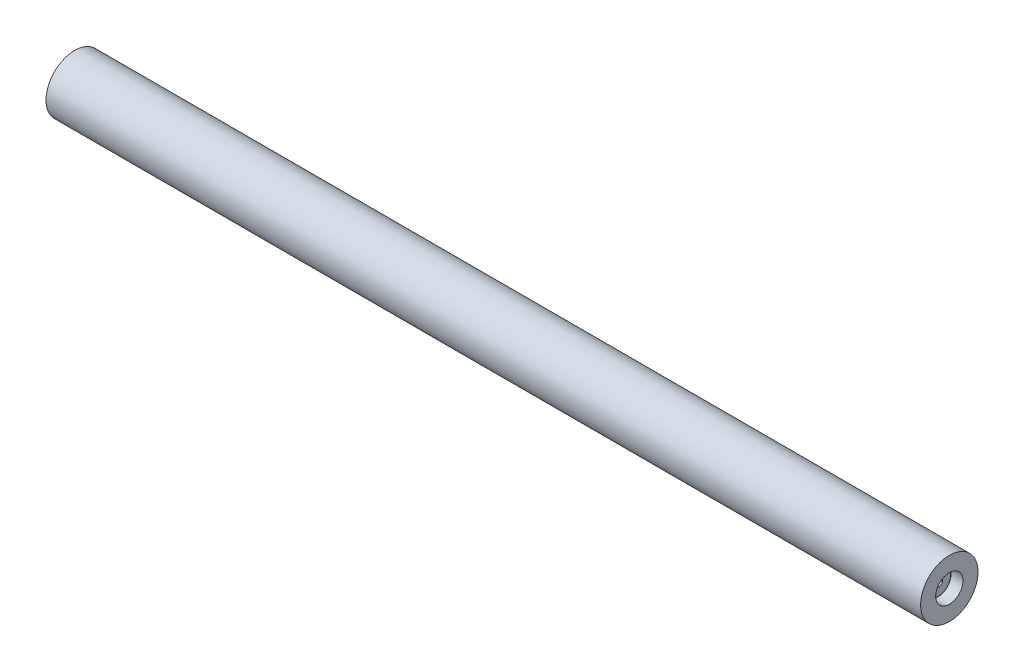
ISO-10303-21;
HEADER;
FILE_DESCRIPTION(('STEP AP214'),'2;1');
FILE_NAME('part.step','',(''),(''),'','','');
FILE_SCHEMA(('AUTOMOTIVE_DESIGN { 1 0 10303 214 1 1 1 1 }'));
ENDSEC;
DATA;
#1=APPLICATION_CONTEXT('core data for automotive mechanical design processes');
#2=APPLICATION_PROTOCOL_DEFINITION('international standard','automotive_design',2000,#1);
#3=PRODUCT_CONTEXT('',#1,'mechanical');
#4=PRODUCT('Part','Part','',(#3));
#5=PRODUCT_RELATED_PRODUCT_CATEGORY('part','',(#4));
#6=PRODUCT_DEFINITION_FORMATION('','',#4);
#7=PRODUCT_DEFINITION_CONTEXT('part definition',#1,'design');
#8=PRODUCT_DEFINITION('design','',#6,#7);
#9=PRODUCT_DEFINITION_SHAPE('','',#8);
#10=(LENGTH_UNIT() NAMED_UNIT(*) SI_UNIT(.MILLI.,.METRE.));
#11=(NAMED_UNIT(*) PLANE_ANGLE_UNIT() SI_UNIT($,.RADIAN.));
#12=(NAMED_UNIT(*) SI_UNIT($,.STERADIAN.) SOLID_ANGLE_UNIT());
#13=UNCERTAINTY_MEASURE_WITH_UNIT(LENGTH_MEASURE(1.E-05),#10,'distance_accuracy_value','');
#14=(GEOMETRIC_REPRESENTATION_CONTEXT(3) GLOBAL_UNCERTAINTY_ASSIGNED_CONTEXT((#13)) GLOBAL_UNIT_ASSIGNED_CONTEXT((#10,
#11,#12)) REPRESENTATION_CONTEXT('',''));
#15=CARTESIAN_POINT('',(0.,0.,0.));
#16=DIRECTION('',(0.,0.,1.));
#17=DIRECTION('',(1.,0.,0.));
#18=AXIS2_PLACEMENT_3D('',#15,#16,#17);
#19=CARTESIAN_POINT('',(4.7625,0.,0.));
#20=DIRECTION('',(1.,0.,0.));
#21=DIRECTION('',(0.,0.,-1.));
#22=AXIS2_PLACEMENT_3D('',#19,#20,#21);
#23=PLANE('',#22);
#24=CARTESIAN_POINT('',(4.7625,0.,0.));
#25=DIRECTION('',(-1.,0.,0.));
#26=DIRECTION('',(0.,0.,1.));
#27=AXIS2_PLACEMENT_3D('',#24,#25,#26);
#28=CIRCLE('',#27,5.2578);
#29=CARTESIAN_POINT('',(4.7625,0.,5.2578));
#30=VERTEX_POINT('',#29);
#31=EDGE_CURVE('E229',#30,#30,#28,.T.);
#32=ORIENTED_EDGE('',*,*,#31,.T.);
#33=EDGE_LOOP('',(#32));
#34=FACE_BOUND('',#33,.T.);
#35=DIRECTION('',(0.,-0.500000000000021,0.866025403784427));
#36=VECTOR('',#35,1.);
#37=CARTESIAN_POINT('',(4.7625,2.1190486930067,0.));
#38=LINE('',#37,#36);
#39=CARTESIAN_POINT('',(4.7625,2.1190486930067,0.));
#40=VERTEX_POINT('',#39);
#41=CARTESIAN_POINT('',(4.7625,1.0595243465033,1.83515));
#42=VERTEX_POINT('',#41);
#43=EDGE_CURVE('E47',#40,#42,#38,.T.);
#44=ORIENTED_EDGE('',*,*,#43,.T.);
#45=DIRECTION('',(0.,-1.,0.));
#46=VECTOR('',#45,1.);
#47=CARTESIAN_POINT('',(4.7625,1.0595243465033,1.83515));
#48=LINE('',#47,#46);
#49=CARTESIAN_POINT('',(4.7625,-1.0595243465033,1.83515));
#50=VERTEX_POINT('',#49);
#51=EDGE_CURVE('E123',#42,#50,#48,.T.);
#52=ORIENTED_EDGE('',*,*,#51,.T.);
#53=DIRECTION('',(0.,-0.500000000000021,-0.866025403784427));
#54=VECTOR('',#53,1.);
#55=CARTESIAN_POINT('',(4.7625,-1.0595243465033,1.83515));
#56=LINE('',#55,#54);
#57=CARTESIAN_POINT('',(4.7625,-2.1190486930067,0.));
#58=VERTEX_POINT('',#57);
#59=EDGE_CURVE('E131',#50,#58,#56,.T.);
#60=ORIENTED_EDGE('',*,*,#59,.T.);
#61=DIRECTION('',(0.,0.500000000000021,-0.866025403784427));
#62=VECTOR('',#61,1.);
#63=CARTESIAN_POINT('',(4.7625,-2.1190486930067,0.));
#64=LINE('',#63,#62);
#65=CARTESIAN_POINT('',(4.7625,-1.0595243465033,-1.83515));
#66=VERTEX_POINT('',#65);
#67=EDGE_CURVE('E145',#58,#66,#64,.T.);
#68=ORIENTED_EDGE('',*,*,#67,.T.);
#69=DIRECTION('',(0.,1.,0.));
#70=VECTOR('',#69,1.);
#71=CARTESIAN_POINT('',(4.7625,-1.0595243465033,-1.83515));
#72=LINE('',#71,#70);
#73=CARTESIAN_POINT('',(4.7625,1.0595243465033,-1.83515));
#74=VERTEX_POINT('',#73);
#75=EDGE_CURVE('E148',#66,#74,#72,.T.);
#76=ORIENTED_EDGE('',*,*,#75,.T.);
#77=DIRECTION('',(0.,0.500000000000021,0.866025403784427));
#78=VECTOR('',#77,1.);
#79=CARTESIAN_POINT('',(4.7625,1.0595243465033,-1.83515));
#80=LINE('',#79,#78);
#81=EDGE_CURVE('E141',#74,#40,#80,.T.);
#82=ORIENTED_EDGE('',*,*,#81,.T.);
#83=EDGE_LOOP('',(#44,#52,#60,#68,#76,#82));
#84=FACE_BOUND('',#83,.T.);
#85=ADVANCED_FACE('F32',(#34,#84),#23,.F.);
#86=CARTESIAN_POINT('',(371.475,0.,0.));
#87=DIRECTION('',(1.,0.,0.));
#88=DIRECTION('',(0.,0.,-1.));
#89=AXIS2_PLACEMENT_3D('',#86,#87,#88);
#90=PLANE('',#89);
#91=CARTESIAN_POINT('',(371.475,0.,0.));
#92=DIRECTION('',(1.,0.,0.));
#93=DIRECTION('',(0.,0.,-1.));
#94=AXIS2_PLACEMENT_3D('',#91,#92,#93);
#95=CIRCLE('',#94,5.9563);
#96=CARTESIAN_POINT('',(371.475,0.,-5.9563));
#97=VERTEX_POINT('',#96);
#98=EDGE_CURVE('E241',#97,#97,#95,.T.);
#99=ORIENTED_EDGE('',*,*,#98,.T.);
#100=EDGE_LOOP('',(#99));
#101=FACE_BOUND('',#100,.T.);
#102=CARTESIAN_POINT('',(371.475,0.,0.));
#103=DIRECTION('',(-1.,0.,0.));
#104=DIRECTION('',(0.,0.,1.));
#105=AXIS2_PLACEMENT_3D('',#102,#103,#104);
#106=CIRCLE('',#105,5.7658);
#107=CARTESIAN_POINT('',(371.475,0.,5.7658));
#108=VERTEX_POINT('',#107);
#109=EDGE_CURVE('E223',#108,#108,#106,.T.);
#110=ORIENTED_EDGE('',*,*,#109,.T.);
#111=EDGE_LOOP('',(#110));
#112=FACE_BOUND('',#111,.T.);
#113=ADVANCED_FACE('F269',(#101,#112),#90,.T.);
#114=CARTESIAN_POINT('',(9.525,0.,0.));
#115=DIRECTION('',(1.,0.,0.));
#116=DIRECTION('',(0.,0.,-1.));
#117=AXIS2_PLACEMENT_3D('',#114,#115,#116);
#118=PLANE('',#117);
#119=CARTESIAN_POINT('',(9.525,0.,0.));
#120=DIRECTION('',(1.,0.,0.));
#121=DIRECTION('',(0.,0.,-1.));
#122=AXIS2_PLACEMENT_3D('',#119,#120,#121);
#123=CIRCLE('',#122,5.9563);
#124=CARTESIAN_POINT('',(9.525,0.,5.9563));
#125=VERTEX_POINT('',#124);
#126=EDGE_CURVE('E235',#125,#125,#123,.T.);
#127=ORIENTED_EDGE('',*,*,#126,.F.);
#128=EDGE_LOOP('',(#127));
#129=FACE_BOUND('',#128,.T.);
#130=CARTESIAN_POINT('',(9.525,0.,0.));
#131=DIRECTION('',(1.,0.,0.));
#132=DIRECTION('',(0.,0.,-1.));
#133=AXIS2_PLACEMENT_3D('',#130,#131,#132);
#134=CIRCLE('',#133,5.7658);
#135=CARTESIAN_POINT('',(9.525,0.,-5.7658));
#136=VERTEX_POINT('',#135);
#137=EDGE_CURVE('E11',#136,#136,#134,.F.);
#138=ORIENTED_EDGE('',*,*,#137,.F.);
#139=EDGE_LOOP('',(#138));
#140=FACE_BOUND('',#139,.T.);
#141=ADVANCED_FACE('F275',(#129,#140),#118,.F.);
#142=CARTESIAN_POINT('',(0.,0.,0.));
#143=DIRECTION('',(1.,0.,0.));
#144=DIRECTION('',(0.,0.,-1.));
#145=AXIS2_PLACEMENT_3D('',#142,#143,#144);
#146=PLANE('',#145);
#147=CARTESIAN_POINT('',(0.,0.,0.));
#148=DIRECTION('',(-1.,0.,0.));
#149=DIRECTION('',(0.,0.,1.));
#150=AXIS2_PLACEMENT_3D('',#147,#148,#149);
#151=CIRCLE('',#150,12.5095);
#152=CARTESIAN_POINT('',(0.,0.,12.5095));
#153=VERTEX_POINT('',#152);
#154=EDGE_CURVE('E40',#153,#153,#151,.T.);
#155=ORIENTED_EDGE('',*,*,#154,.T.);
#156=EDGE_LOOP('',(#155));
#157=FACE_BOUND('',#156,.T.);
#158=CARTESIAN_POINT('',(0.,0.,0.));
#159=DIRECTION('',(1.,0.,0.));
#160=DIRECTION('',(0.,0.,-1.));
#161=AXIS2_PLACEMENT_3D('',#158,#159,#160);
#162=CIRCLE('',#161,5.9563);
#163=CARTESIAN_POINT('',(0.,0.,5.9563));
#164=VERTEX_POINT('',#163);
#165=EDGE_CURVE('E232',#164,#164,#162,.T.);
#166=ORIENTED_EDGE('',*,*,#165,.T.);
#167=EDGE_LOOP('',(#166));
#168=FACE_BOUND('',#167,.T.);
#169=ADVANCED_FACE('F34',(#157,#168),#146,.F.);
#170=CARTESIAN_POINT('',(381.,0.,0.));
#171=DIRECTION('',(-1.,0.,0.));
#172=DIRECTION('',(0.,0.,1.));
#173=AXIS2_PLACEMENT_3D('',#170,#171,#172);
#174=CYLINDRICAL_SURFACE('',#173,12.5095);
#175=ORIENTED_EDGE('',*,*,#154,.F.);
#176=EDGE_LOOP('',(#175));
#177=FACE_BOUND('',#176,.T.);
#178=CARTESIAN_POINT('',(381.,0.,0.));
#179=DIRECTION('',(-1.,0.,0.));
#180=DIRECTION('',(0.,0.,1.));
#181=AXIS2_PLACEMENT_3D('',#178,#179,#180);
#182=CIRCLE('',#181,12.5095);
#183=CARTESIAN_POINT('',(381.,0.,12.5095));
#184=VERTEX_POINT('',#183);
#185=EDGE_CURVE('E244',#184,#184,#182,.T.);
#186=ORIENTED_EDGE('',*,*,#185,.T.);
#187=EDGE_LOOP('',(#186));
#188=FACE_BOUND('',#187,.T.);
#189=ADVANCED_FACE('F251',(#177,#188),#174,.T.);
#190=CARTESIAN_POINT('',(381.,12.5095,0.));
#191=DIRECTION('',(-1.,0.,0.));
#192=DIRECTION('',(0.,0.,1.));
#193=AXIS2_PLACEMENT_3D('',#190,#191,#192);
#194=PLANE('',#193);
#195=CARTESIAN_POINT('',(381.,0.,0.));
#196=DIRECTION('',(1.,0.,0.));
#197=DIRECTION('',(0.,0.,-1.));
#198=AXIS2_PLACEMENT_3D('',#195,#196,#197);
#199=CIRCLE('',#198,5.9563);
#200=CARTESIAN_POINT('',(381.,0.,-5.9563));
#201=VERTEX_POINT('',#200);
#202=EDGE_CURVE('E238',#201,#201,#199,.T.);
#203=ORIENTED_EDGE('',*,*,#202,.F.);
#204=EDGE_LOOP('',(#203));
#205=FACE_BOUND('',#204,.T.);
#206=ORIENTED_EDGE('',*,*,#185,.F.);
#207=EDGE_LOOP('',(#206));
#208=FACE_BOUND('',#207,.T.);
#209=ADVANCED_FACE('F254',(#205,#208),#194,.F.);
#210=CARTESIAN_POINT('',(371.475,0.,0.));
#211=DIRECTION('',(1.,0.,0.));
#212=DIRECTION('',(0.,0.,-1.));
#213=AXIS2_PLACEMENT_3D('',#210,#211,#212);
#214=CYLINDRICAL_SURFACE('',#213,5.9563);
#215=CARTESIAN_POINT('',(371.475,0.,-5.9563));
#216=CARTESIAN_POINT('',(371.57421875,0.,-5.9563));
#217=CARTESIAN_POINT('',(371.6734375,0.,-5.9563));
#218=CARTESIAN_POINT('',(371.871875,0.,-5.9563));
#219=CARTESIAN_POINT('',(371.97109375,0.,-5.9563));
#220=CARTESIAN_POINT('',(372.16953125,0.,-5.9563));
#221=CARTESIAN_POINT('',(372.26875,0.,-5.9563));
#222=CARTESIAN_POINT('',(372.4671875,0.,-5.9563));
#223=CARTESIAN_POINT('',(372.56640625,0.,-5.9563));
#224=CARTESIAN_POINT('',(372.76484375,0.,-5.9563));
#225=CARTESIAN_POINT('',(372.8640625,0.,-5.9563));
#226=CARTESIAN_POINT('',(373.0625,0.,-5.9563));
#227=CARTESIAN_POINT('',(373.16171875,0.,-5.9563));
#228=CARTESIAN_POINT('',(373.36015625,0.,-5.9563));
#229=CARTESIAN_POINT('',(373.459375,0.,-5.9563));
#230=CARTESIAN_POINT('',(373.6578125,0.,-5.9563));
#231=CARTESIAN_POINT('',(373.75703125,0.,-5.9563));
#232=CARTESIAN_POINT('',(373.95546875,0.,-5.9563));
#233=CARTESIAN_POINT('',(374.0546875,0.,-5.9563));
#234=CARTESIAN_POINT('',(374.253125,0.,-5.9563));
#235=CARTESIAN_POINT('',(374.35234375,0.,-5.9563));
#236=CARTESIAN_POINT('',(374.55078125,0.,-5.9563));
#237=CARTESIAN_POINT('',(374.65,0.,-5.9563));
#238=CARTESIAN_POINT('',(374.8484375,0.,-5.9563));
#239=CARTESIAN_POINT('',(374.94765625,0.,-5.9563));
#240=CARTESIAN_POINT('',(375.14609375,0.,-5.9563));
#241=CARTESIAN_POINT('',(375.2453125,0.,-5.9563));
#242=CARTESIAN_POINT('',(375.44375,0.,-5.9563));
#243=CARTESIAN_POINT('',(375.54296875,0.,-5.9563));
#244=CARTESIAN_POINT('',(375.74140625,0.,-5.9563));
#245=CARTESIAN_POINT('',(375.840625,0.,-5.9563));
#246=CARTESIAN_POINT('',(376.0390625,0.,-5.9563));
#247=CARTESIAN_POINT('',(376.13828125,0.,-5.9563));
#248=CARTESIAN_POINT('',(376.33671875,0.,-5.9563));
#249=CARTESIAN_POINT('',(376.4359375,0.,-5.9563));
#250=CARTESIAN_POINT('',(376.634375,0.,-5.9563));
#251=CARTESIAN_POINT('',(376.73359375,0.,-5.9563));
#252=CARTESIAN_POINT('',(376.93203125,0.,-5.9563));
#253=CARTESIAN_POINT('',(377.03125,0.,-5.9563));
#254=CARTESIAN_POINT('',(377.2296875,0.,-5.9563));
#255=CARTESIAN_POINT('',(377.32890625,0.,-5.9563));
#256=CARTESIAN_POINT('',(377.52734375,0.,-5.9563));
#257=CARTESIAN_POINT('',(377.6265625,0.,-5.9563));
#258=CARTESIAN_POINT('',(377.825,0.,-5.9563));
#259=CARTESIAN_POINT('',(377.92421875,0.,-5.9563));
#260=CARTESIAN_POINT('',(378.12265625,0.,-5.9563));
#261=CARTESIAN_POINT('',(378.221875,0.,-5.9563));
#262=CARTESIAN_POINT('',(378.4203125,0.,-5.9563));
#263=CARTESIAN_POINT('',(378.51953125,0.,-5.9563));
#264=CARTESIAN_POINT('',(378.71796875,0.,-5.9563));
#265=CARTESIAN_POINT('',(378.8171875,0.,-5.9563));
#266=CARTESIAN_POINT('',(379.015625,0.,-5.9563));
#267=CARTESIAN_POINT('',(379.11484375,0.,-5.9563));
#268=CARTESIAN_POINT('',(379.31328125,0.,-5.9563));
#269=CARTESIAN_POINT('',(379.4125,0.,-5.9563));
#270=CARTESIAN_POINT('',(379.6109375,0.,-5.9563));
#271=CARTESIAN_POINT('',(379.71015625,0.,-5.9563));
#272=CARTESIAN_POINT('',(379.90859375,0.,-5.9563));
#273=CARTESIAN_POINT('',(380.0078125,0.,-5.9563));
#274=CARTESIAN_POINT('',(380.20625,0.,-5.9563));
#275=CARTESIAN_POINT('',(380.30546875,0.,-5.9563));
#276=CARTESIAN_POINT('',(380.50390625,0.,-5.9563));
#277=CARTESIAN_POINT('',(380.603125,0.,-5.9563));
#278=CARTESIAN_POINT('',(380.8015625,0.,-5.9563));
#279=CARTESIAN_POINT('',(380.90078125,0.,-5.9563));
#280=CARTESIAN_POINT('',(381.,0.,-5.9563));
#281=B_SPLINE_CURVE_WITH_KNOTS('',3,(#215,#216,#217,#218,#219,#220,#221,#222,#223,#224,#225,
#226,#227,#228,#229,#230,#231,#232,#233,#234,#235,#236,#237,#238,#239,#240,#241,#242,#243,#244,
#245,#246,#247,#248,#249,#250,#251,#252,#253,#254,#255,#256,#257,#258,#259,#260,#261,#262,#263,
#264,#265,#266,#267,#268,#269,#270,#271,#272,#273,#274,#275,#276,#277,#278,#279,#280),
.UNSPECIFIED.,.F.,.F.,(4,2,2,2,2,2,2,2,2,2,2,2,2,2,2,2,2,2,2,2,2,2,2,2,2,2,2,2,2,2,2,2,4),(0.,
0.29765625,0.5953125,0.892968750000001,1.190625,1.48828125,1.7859375,2.08359375,2.38125,
2.67890625,2.9765625,3.27421875,3.571875,3.86953125,4.1671875,4.46484375,4.7625,5.06015625,
5.3578125,5.65546875,5.953125,6.25078125,6.5484375,6.84609375,7.14375,7.44140625,7.7390625,
8.03671875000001,8.334375,8.63203125,8.92968750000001,9.22734375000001,9.52500000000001),.UNSPECIFIED.);
#282=EDGE_CURVE('BSEAM258',#97,#201,#281,.T.);
#283=ORIENTED_EDGE('',*,*,#98,.F.);
#284=ORIENTED_EDGE('',*,*,#202,.T.);
#285=ORIENTED_EDGE('',*,*,#282,.T.);
#286=ORIENTED_EDGE('',*,*,#282,.F.);
#287=EDGE_LOOP('',(#283,#285,#284,#286));
#288=FACE_BOUND('',#287,.T.);
#289=ADVANCED_FACE('F258',(#288),#214,.F.);
#290=CARTESIAN_POINT('',(9.525,0.,0.));
#291=DIRECTION('',(-1.,0.,0.));
#292=DIRECTION('',(0.,0.,1.));
#293=AXIS2_PLACEMENT_3D('',#290,#291,#292);
#294=CYLINDRICAL_SURFACE('',#293,5.9563);
#295=CARTESIAN_POINT('',(9.525,0.,5.9563));
#296=CARTESIAN_POINT('',(9.42578125,0.,5.9563));
#297=CARTESIAN_POINT('',(9.3265625,0.,5.9563));
#298=CARTESIAN_POINT('',(9.128125,0.,5.9563));
#299=CARTESIAN_POINT('',(9.02890625,0.,5.9563));
#300=CARTESIAN_POINT('',(8.83046875,0.,5.9563));
#301=CARTESIAN_POINT('',(8.73125,0.,5.9563));
#302=CARTESIAN_POINT('',(8.5328125,0.,5.9563));
#303=CARTESIAN_POINT('',(8.43359375,0.,5.9563));
#304=CARTESIAN_POINT('',(8.23515625,0.,5.9563));
#305=CARTESIAN_POINT('',(8.1359375,0.,5.9563));
#306=CARTESIAN_POINT('',(7.9375,0.,5.9563));
#307=CARTESIAN_POINT('',(7.83828125,0.,5.9563));
#308=CARTESIAN_POINT('',(7.63984375,0.,5.9563));
#309=CARTESIAN_POINT('',(7.540625,0.,5.9563));
#310=CARTESIAN_POINT('',(7.3421875,0.,5.9563));
#311=CARTESIAN_POINT('',(7.24296875,0.,5.9563));
#312=CARTESIAN_POINT('',(7.04453125,0.,5.9563));
#313=CARTESIAN_POINT('',(6.9453125,0.,5.9563));
#314=CARTESIAN_POINT('',(6.746875,0.,5.9563));
#315=CARTESIAN_POINT('',(6.64765625,0.,5.9563));
#316=CARTESIAN_POINT('',(6.44921875,0.,5.9563));
#317=CARTESIAN_POINT('',(6.35,0.,5.9563));
#318=CARTESIAN_POINT('',(6.1515625,0.,5.9563));
#319=CARTESIAN_POINT('',(6.05234375,0.,5.9563));
#320=CARTESIAN_POINT('',(5.85390625,0.,5.9563));
#321=CARTESIAN_POINT('',(5.7546875,0.,5.9563));
#322=CARTESIAN_POINT('',(5.55625,0.,5.9563));
#323=CARTESIAN_POINT('',(5.45703125,0.,5.9563));
#324=CARTESIAN_POINT('',(5.25859375,0.,5.9563));
#325=CARTESIAN_POINT('',(5.159375,0.,5.9563));
#326=CARTESIAN_POINT('',(4.9609375,0.,5.9563));
#327=CARTESIAN_POINT('',(4.86171875,0.,5.9563));
#328=CARTESIAN_POINT('',(4.66328125,0.,5.9563));
#329=CARTESIAN_POINT('',(4.5640625,0.,5.9563));
#330=CARTESIAN_POINT('',(4.365625,0.,5.9563));
#331=CARTESIAN_POINT('',(4.26640625,0.,5.9563));
#332=CARTESIAN_POINT('',(4.06796875,0.,5.9563));
#333=CARTESIAN_POINT('',(3.96875,0.,5.9563));
#334=CARTESIAN_POINT('',(3.7703125,0.,5.9563));
#335=CARTESIAN_POINT('',(3.67109375,0.,5.9563));
#336=CARTESIAN_POINT('',(3.47265625,0.,5.9563));
#337=CARTESIAN_POINT('',(3.3734375,0.,5.9563));
#338=CARTESIAN_POINT('',(3.175,0.,5.9563));
#339=CARTESIAN_POINT('',(3.07578125,0.,5.9563));
#340=CARTESIAN_POINT('',(2.87734375,0.,5.9563));
#341=CARTESIAN_POINT('',(2.778125,0.,5.9563));
#342=CARTESIAN_POINT('',(2.5796875,0.,5.9563));
#343=CARTESIAN_POINT('',(2.48046875,0.,5.9563));
#344=CARTESIAN_POINT('',(2.28203125,0.,5.9563));
#345=CARTESIAN_POINT('',(2.1828125,0.,5.9563));
#346=CARTESIAN_POINT('',(1.984375,0.,5.9563));
#347=CARTESIAN_POINT('',(1.88515625,0.,5.9563));
#348=CARTESIAN_POINT('',(1.68671875,0.,5.9563));
#349=CARTESIAN_POINT('',(1.5875,0.,5.9563));
#350=CARTESIAN_POINT('',(1.3890625,0.,5.9563));
#351=CARTESIAN_POINT('',(1.28984375,0.,5.9563));
#352=CARTESIAN_POINT('',(1.09140625,0.,5.9563));
#353=CARTESIAN_POINT('',(0.992187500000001,0.,5.9563));
#354=CARTESIAN_POINT('',(0.793750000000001,0.,5.9563));
#355=CARTESIAN_POINT('',(0.69453125,0.,5.9563));
#356=CARTESIAN_POINT('',(0.49609375,0.,5.9563));
#357=CARTESIAN_POINT('',(0.396875,0.,5.9563));
#358=CARTESIAN_POINT('',(0.1984375,0.,5.9563));
#359=CARTESIAN_POINT('',(0.0992187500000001,0.,5.9563));
#360=CARTESIAN_POINT('',(0.,0.,5.9563));
#361=B_SPLINE_CURVE_WITH_KNOTS('',3,(#295,#296,#297,#298,#299,#300,#301,#302,#303,#304,#305,
#306,#307,#308,#309,#310,#311,#312,#313,#314,#315,#316,#317,#318,#319,#320,#321,#322,#323,#324,
#325,#326,#327,#328,#329,#330,#331,#332,#333,#334,#335,#336,#337,#338,#339,#340,#341,#342,#343,
#344,#345,#346,#347,#348,#349,#350,#351,#352,#353,#354,#355,#356,#357,#358,#359,#360),
.UNSPECIFIED.,.F.,.F.,(4,2,2,2,2,2,2,2,2,2,2,2,2,2,2,2,2,2,2,2,2,2,2,2,2,2,2,2,2,2,2,2,4),(0.,
0.29765625,0.5953125,0.892968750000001,1.190625,1.48828125,1.7859375,2.08359375,2.38125,
2.67890625,2.9765625,3.27421875,3.571875,3.86953125,4.1671875,4.46484375,4.7625,5.06015625,
5.3578125,5.65546875,5.953125,6.25078125,6.5484375,6.84609375,7.14375,7.44140625,7.7390625,
8.03671875,8.334375,8.63203125,8.9296875,9.22734375,9.525),.UNSPECIFIED.);
#362=EDGE_CURVE('BSEAM264',#125,#164,#361,.T.);
#363=ORIENTED_EDGE('',*,*,#126,.T.);
#364=ORIENTED_EDGE('',*,*,#165,.F.);
#365=ORIENTED_EDGE('',*,*,#362,.T.);
#366=ORIENTED_EDGE('',*,*,#362,.F.);
#367=EDGE_LOOP('',(#363,#365,#364,#366));
#368=FACE_BOUND('',#367,.T.);
#369=ADVANCED_FACE('F264',(#368),#294,.F.);
#370=CARTESIAN_POINT('',(5.27049999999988,0.,0.));
#371=DIRECTION('',(-1.,0.,0.));
#372=DIRECTION('',(0.,0.,1.));
#373=AXIS2_PLACEMENT_3D('',#370,#371,#372);
#374=TOROIDAL_SURFACE('',#373,5.25780000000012,0.507999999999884);
#375=ORIENTED_EDGE('',*,*,#31,.F.);
#376=EDGE_LOOP('',(#375));
#377=FACE_BOUND('',#376,.T.);
#378=CARTESIAN_POINT('',(5.2705,0.,0.));
#379=DIRECTION('',(-1.,0.,0.));
#380=DIRECTION('',(0.,0.,1.));
#381=AXIS2_PLACEMENT_3D('',#378,#379,#380);
#382=CIRCLE('',#381,5.7658);
#383=CARTESIAN_POINT('',(5.2705,0.,5.7658));
#384=VERTEX_POINT('',#383);
#385=EDGE_CURVE('E226',#384,#384,#382,.T.);
#386=ORIENTED_EDGE('',*,*,#385,.T.);
#387=EDGE_LOOP('',(#386));
#388=FACE_BOUND('',#387,.T.);
#389=ADVANCED_FACE('F280',(#377,#388),#374,.T.);
#390=CARTESIAN_POINT('',(9.525,0.,0.));
#391=DIRECTION('',(-1.,0.,0.));
#392=DIRECTION('',(0.,0.,1.));
#393=AXIS2_PLACEMENT_3D('',#390,#391,#392);
#394=CYLINDRICAL_SURFACE('',#393,5.7658);
#395=ORIENTED_EDGE('',*,*,#385,.F.);
#396=EDGE_LOOP('',(#395));
#397=FACE_BOUND('',#396,.T.);
#398=ORIENTED_EDGE('',*,*,#137,.T.);
#399=EDGE_LOOP('',(#398));
#400=FACE_BOUND('',#399,.T.);
#401=ADVANCED_FACE('F290',(#397,#400),#394,.T.);
#402=CARTESIAN_POINT('',(376.2375,0.,0.));
#403=DIRECTION('',(-1.,0.,0.));
#404=DIRECTION('',(0.,0.,1.));
#405=AXIS2_PLACEMENT_3D('',#402,#403,#404);
#406=CYLINDRICAL_SURFACE('',#405,5.7658);
#407=ORIENTED_EDGE('',*,*,#109,.F.);
#408=EDGE_LOOP('',(#407));
#409=FACE_BOUND('',#408,.T.);
#410=CARTESIAN_POINT('',(375.7295,0.,0.));
#411=DIRECTION('',(-1.,0.,0.));
#412=DIRECTION('',(0.,0.,1.));
#413=AXIS2_PLACEMENT_3D('',#410,#411,#412);
#414=CIRCLE('',#413,5.7658);
#415=CARTESIAN_POINT('',(375.7295,0.,5.7658));
#416=VERTEX_POINT('',#415);
#417=EDGE_CURVE('E220',#416,#416,#414,.T.);
#418=ORIENTED_EDGE('',*,*,#417,.T.);
#419=EDGE_LOOP('',(#418));
#420=FACE_BOUND('',#419,.T.);
#421=ADVANCED_FACE('F339',(#409,#420),#406,.T.);
#422=CARTESIAN_POINT('',(375.729499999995,0.,0.));
#423=DIRECTION('',(-1.,0.,0.));
#424=DIRECTION('',(0.,0.,1.));
#425=AXIS2_PLACEMENT_3D('',#422,#423,#424);
#426=TOROIDAL_SURFACE('',#425,5.25779999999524,0.508000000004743);
#427=ORIENTED_EDGE('',*,*,#417,.F.);
#428=EDGE_LOOP('',(#427));
#429=FACE_BOUND('',#428,.T.);
#430=CARTESIAN_POINT('',(376.2375,0.,0.));
#431=DIRECTION('',(-1.,0.,0.));
#432=DIRECTION('',(0.,0.,1.));
#433=AXIS2_PLACEMENT_3D('',#430,#431,#432);
#434=CIRCLE('',#433,5.2578);
#435=CARTESIAN_POINT('',(376.2375,0.,5.2578));
#436=VERTEX_POINT('',#435);
#437=EDGE_CURVE('E208',#436,#436,#434,.T.);
#438=ORIENTED_EDGE('',*,*,#437,.T.);
#439=EDGE_LOOP('',(#438));
#440=FACE_BOUND('',#439,.T.);
#441=ADVANCED_FACE('F352',(#429,#440),#426,.T.);
#442=CARTESIAN_POINT('',(376.2375,5.2578,0.));
#443=DIRECTION('',(-1.,0.,0.));
#444=DIRECTION('',(0.,0.,1.));
#445=AXIS2_PLACEMENT_3D('',#442,#443,#444);
#446=PLANE('',#445);
#447=DIRECTION('',(0.,-1.,0.));
#448=VECTOR('',#447,1.);
#449=CARTESIAN_POINT('',(376.2375,1.0595243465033,1.83515));
#450=LINE('',#449,#448);
#451=CARTESIAN_POINT('',(376.2375,1.0595243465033,1.83515));
#452=VERTEX_POINT('',#451);
#453=CARTESIAN_POINT('',(376.2375,-1.0595243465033,1.83515));
#454=VERTEX_POINT('',#453);
#455=EDGE_CURVE('E172',#452,#454,#450,.T.);
#456=ORIENTED_EDGE('',*,*,#455,.F.);
#457=DIRECTION('',(0.,-0.500000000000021,0.866025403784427));
#458=VECTOR('',#457,1.);
#459=CARTESIAN_POINT('',(376.2375,2.1190486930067,0.));
#460=LINE('',#459,#458);
#461=CARTESIAN_POINT('',(376.2375,2.1190486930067,0.));
#462=VERTEX_POINT('',#461);
#463=EDGE_CURVE('E55',#462,#452,#460,.T.);
#464=ORIENTED_EDGE('',*,*,#463,.F.);
#465=DIRECTION('',(0.,0.500000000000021,0.866025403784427));
#466=VECTOR('',#465,1.);
#467=CARTESIAN_POINT('',(376.2375,1.0595243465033,-1.83515));
#468=LINE('',#467,#466);
#469=CARTESIAN_POINT('',(376.2375,1.0595243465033,-1.83515));
#470=VERTEX_POINT('',#469);
#471=EDGE_CURVE('E184',#470,#462,#468,.T.);
#472=ORIENTED_EDGE('',*,*,#471,.F.);
#473=DIRECTION('',(0.,1.,0.));
#474=VECTOR('',#473,1.);
#475=CARTESIAN_POINT('',(376.2375,-1.0595243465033,-1.83515));
#476=LINE('',#475,#474);
#477=CARTESIAN_POINT('',(376.2375,-1.0595243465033,-1.83515));
#478=VERTEX_POINT('',#477);
#479=EDGE_CURVE('E181',#478,#470,#476,.T.);
#480=ORIENTED_EDGE('',*,*,#479,.F.);
#481=DIRECTION('',(0.,0.500000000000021,-0.866025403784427));
#482=VECTOR('',#481,1.);
#483=CARTESIAN_POINT('',(376.2375,-2.1190486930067,0.));
#484=LINE('',#483,#482);
#485=CARTESIAN_POINT('',(376.2375,-2.1190486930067,0.));
#486=VERTEX_POINT('',#485);
#487=EDGE_CURVE('E178',#486,#478,#484,.T.);
#488=ORIENTED_EDGE('',*,*,#487,.F.);
#489=DIRECTION('',(0.,-0.500000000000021,-0.866025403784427));
#490=VECTOR('',#489,1.);
#491=CARTESIAN_POINT('',(376.2375,-1.0595243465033,1.83515));
#492=LINE('',#491,#490);
#493=EDGE_CURVE('E175',#454,#486,#492,.T.);
#494=ORIENTED_EDGE('',*,*,#493,.F.);
#495=EDGE_LOOP('',(#456,#464,#472,#480,#488,#494));
#496=FACE_BOUND('',#495,.T.);
#497=ORIENTED_EDGE('',*,*,#437,.F.);
#498=EDGE_LOOP('',(#497));
#499=FACE_BOUND('',#498,.T.);
#500=ADVANCED_FACE('F361',(#496,#499),#446,.F.);
#501=CARTESIAN_POINT('',(373.85625,2.1190486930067,0.));
#502=DIRECTION('',(0.,0.866025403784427,0.500000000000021));
#503=DIRECTION('',(0.,-0.500000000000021,0.866025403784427));
#504=AXIS2_PLACEMENT_3D('',#501,#502,#503);
#505=PLANE('',#504);
#506=ORIENTED_EDGE('',*,*,#463,.T.);
#507=DIRECTION('',(1.,0.,0.));
#508=VECTOR('',#507,1.);
#509=CARTESIAN_POINT('',(373.85625,1.0595243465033,1.83515));
#510=LINE('',#509,#508);
#511=CARTESIAN_POINT('',(373.85625,1.0595243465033,1.83515));
#512=VERTEX_POINT('',#511);
#513=EDGE_CURVE('E205',#512,#452,#510,.T.);
#514=ORIENTED_EDGE('',*,*,#513,.F.);
#515=DIRECTION('',(0.,-0.500000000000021,0.866025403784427));
#516=VECTOR('',#515,1.);
#517=CARTESIAN_POINT('',(373.85625,2.1190486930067,0.));
#518=LINE('',#517,#516);
#519=CARTESIAN_POINT('',(373.85625,2.1190486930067,0.));
#520=VERTEX_POINT('',#519);
#521=EDGE_CURVE('E187',#520,#512,#518,.T.);
#522=ORIENTED_EDGE('',*,*,#521,.F.);
#523=DIRECTION('',(1.,0.,0.));
#524=VECTOR('',#523,1.);
#525=CARTESIAN_POINT('',(373.85625,2.1190486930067,0.));
#526=LINE('',#525,#524);
#527=EDGE_CURVE('E206',#520,#462,#526,.T.);
#528=ORIENTED_EDGE('',*,*,#527,.T.);
#529=EDGE_LOOP('',(#506,#514,#522,#528));
#530=FACE_BOUND('',#529,.T.);
#531=ADVANCED_FACE('F370',(#530),#505,.F.);
#532=CARTESIAN_POINT('',(373.85625,1.0595243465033,-1.83515));
#533=DIRECTION('',(0.,0.866025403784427,-0.500000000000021));
#534=DIRECTION('',(0.,0.500000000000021,0.866025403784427));
#535=AXIS2_PLACEMENT_3D('',#532,#533,#534);
#536=PLANE('',#535);
#537=ORIENTED_EDGE('',*,*,#471,.T.);
#538=ORIENTED_EDGE('',*,*,#527,.F.);
#539=DIRECTION('',(0.,0.500000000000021,0.866025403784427));
#540=VECTOR('',#539,1.);
#541=CARTESIAN_POINT('',(373.85625,1.0595243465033,-1.83515));
#542=LINE('',#541,#540);
#543=CARTESIAN_POINT('',(373.85625,1.0595243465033,-1.83515));
#544=VERTEX_POINT('',#543);
#545=EDGE_CURVE('E202',#544,#520,#542,.T.);
#546=ORIENTED_EDGE('',*,*,#545,.F.);
#547=DIRECTION('',(1.,0.,0.));
#548=VECTOR('',#547,1.);
#549=CARTESIAN_POINT('',(373.85625,1.0595243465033,-1.83515));
#550=LINE('',#549,#548);
#551=EDGE_CURVE('E209',#544,#470,#550,.T.);
#552=ORIENTED_EDGE('',*,*,#551,.T.);
#553=EDGE_LOOP('',(#537,#538,#546,#552));
#554=FACE_BOUND('',#553,.T.);
#555=ADVANCED_FACE('F379',(#554),#536,.F.);
#556=CARTESIAN_POINT('',(373.85625,-1.0595243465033,-1.83515));
#557=DIRECTION('',(0.,0.,-1.));
#558=DIRECTION('',(-1.,0.,0.));
#559=AXIS2_PLACEMENT_3D('',#556,#557,#558);
#560=PLANE('',#559);
#561=ORIENTED_EDGE('',*,*,#479,.T.);
#562=ORIENTED_EDGE('',*,*,#551,.F.);
#563=DIRECTION('',(0.,1.,0.));
#564=VECTOR('',#563,1.);
#565=CARTESIAN_POINT('',(373.85625,-1.0595243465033,-1.83515));
#566=LINE('',#565,#564);
#567=CARTESIAN_POINT('',(373.85625,-1.0595243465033,-1.83515));
#568=VERTEX_POINT('',#567);
#569=EDGE_CURVE('E199',#568,#544,#566,.T.);
#570=ORIENTED_EDGE('',*,*,#569,.F.);
#571=DIRECTION('',(1.,0.,0.));
#572=VECTOR('',#571,1.);
#573=CARTESIAN_POINT('',(373.85625,-1.0595243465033,-1.83515));
#574=LINE('',#573,#572);
#575=EDGE_CURVE('E211',#568,#478,#574,.T.);
#576=ORIENTED_EDGE('',*,*,#575,.T.);
#577=EDGE_LOOP('',(#561,#562,#570,#576));
#578=FACE_BOUND('',#577,.T.);
#579=ADVANCED_FACE('F387',(#578),#560,.F.);
#580=CARTESIAN_POINT('',(373.85625,-2.1190486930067,0.));
#581=DIRECTION('',(0.,-0.866025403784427,-0.500000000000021));
#582=DIRECTION('',(0.,0.500000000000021,-0.866025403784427));
#583=AXIS2_PLACEMENT_3D('',#580,#581,#582);
#584=PLANE('',#583);
#585=ORIENTED_EDGE('',*,*,#487,.T.);
#586=ORIENTED_EDGE('',*,*,#575,.F.);
#587=DIRECTION('',(0.,0.500000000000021,-0.866025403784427));
#588=VECTOR('',#587,1.);
#589=CARTESIAN_POINT('',(373.85625,-2.1190486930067,0.));
#590=LINE('',#589,#588);
#591=CARTESIAN_POINT('',(373.85625,-2.1190486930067,0.));
#592=VERTEX_POINT('',#591);
#593=EDGE_CURVE('E196',#592,#568,#590,.T.);
#594=ORIENTED_EDGE('',*,*,#593,.F.);
#595=DIRECTION('',(1.,0.,0.));
#596=VECTOR('',#595,1.);
#597=CARTESIAN_POINT('',(373.85625,-2.1190486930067,0.));
#598=LINE('',#597,#596);
#599=EDGE_CURVE('E213',#592,#486,#598,.T.);
#600=ORIENTED_EDGE('',*,*,#599,.T.);
#601=EDGE_LOOP('',(#585,#586,#594,#600));
#602=FACE_BOUND('',#601,.T.);
#603=ADVANCED_FACE('F396',(#602),#584,.F.);
#604=CARTESIAN_POINT('',(373.85625,-1.0595243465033,1.83515));
#605=DIRECTION('',(0.,-0.866025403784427,0.500000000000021));
#606=DIRECTION('',(0.,-0.500000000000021,-0.866025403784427));
#607=AXIS2_PLACEMENT_3D('',#604,#605,#606);
#608=PLANE('',#607);
#609=ORIENTED_EDGE('',*,*,#493,.T.);
#610=ORIENTED_EDGE('',*,*,#599,.F.);
#611=DIRECTION('',(0.,-0.500000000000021,-0.866025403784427));
#612=VECTOR('',#611,1.);
#613=CARTESIAN_POINT('',(373.85625,-1.0595243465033,1.83515));
#614=LINE('',#613,#612);
#615=CARTESIAN_POINT('',(373.85625,-1.0595243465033,1.83515));
#616=VERTEX_POINT('',#615);
#617=EDGE_CURVE('E193',#616,#592,#614,.T.);
#618=ORIENTED_EDGE('',*,*,#617,.F.);
#619=DIRECTION('',(1.,0.,0.));
#620=VECTOR('',#619,1.);
#621=CARTESIAN_POINT('',(373.85625,-1.0595243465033,1.83515));
#622=LINE('',#621,#620);
#623=EDGE_CURVE('E215',#616,#454,#622,.T.);
#624=ORIENTED_EDGE('',*,*,#623,.T.);
#625=EDGE_LOOP('',(#609,#610,#618,#624));
#626=FACE_BOUND('',#625,.T.);
#627=ADVANCED_FACE('F405',(#626),#608,.F.);
#628=CARTESIAN_POINT('',(373.85625,1.0595243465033,1.83515));
#629=DIRECTION('',(0.,0.,1.));
#630=DIRECTION('',(1.,0.,0.));
#631=AXIS2_PLACEMENT_3D('',#628,#629,#630);
#632=PLANE('',#631);
#633=ORIENTED_EDGE('',*,*,#455,.T.);
#634=ORIENTED_EDGE('',*,*,#623,.F.);
#635=DIRECTION('',(0.,-1.,0.));
#636=VECTOR('',#635,1.);
#637=CARTESIAN_POINT('',(373.85625,1.0595243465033,1.83515));
#638=LINE('',#637,#636);
#639=EDGE_CURVE('E190',#512,#616,#638,.T.);
#640=ORIENTED_EDGE('',*,*,#639,.F.);
#641=ORIENTED_EDGE('',*,*,#513,.T.);
#642=EDGE_LOOP('',(#633,#634,#640,#641));
#643=FACE_BOUND('',#642,.T.);
#644=ADVANCED_FACE('F414',(#643),#632,.F.);
#645=CARTESIAN_POINT('',(373.85625,0.,3.67029999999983));
#646=DIRECTION('',(1.,0.,0.));
#647=DIRECTION('',(0.,0.,-1.));
#648=AXIS2_PLACEMENT_3D('',#645,#646,#647);
#649=PLANE('',#648);
#650=ORIENTED_EDGE('',*,*,#521,.T.);
#651=ORIENTED_EDGE('',*,*,#639,.T.);
#652=ORIENTED_EDGE('',*,*,#617,.T.);
#653=ORIENTED_EDGE('',*,*,#593,.T.);
#654=ORIENTED_EDGE('',*,*,#569,.T.);
#655=ORIENTED_EDGE('',*,*,#545,.T.);
#656=EDGE_LOOP('',(#650,#651,#652,#653,#654,#655));
#657=FACE_BOUND('',#656,.T.);
#658=ADVANCED_FACE('F423',(#657),#649,.T.);
#659=CARTESIAN_POINT('',(7.14375,2.1190486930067,0.));
#660=DIRECTION('',(0.,-0.866025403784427,-0.500000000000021));
#661=DIRECTION('',(0.,0.500000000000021,-0.866025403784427));
#662=AXIS2_PLACEMENT_3D('',#659,#660,#661);
#663=PLANE('',#662);
#664=ORIENTED_EDGE('',*,*,#43,.F.);
#665=DIRECTION('',(-1.,0.,0.));
#666=VECTOR('',#665,1.);
#667=CARTESIAN_POINT('',(7.14375,2.1190486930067,0.));
#668=LINE('',#667,#666);
#669=CARTESIAN_POINT('',(7.14375,2.1190486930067,0.));
#670=VERTEX_POINT('',#669);
#671=EDGE_CURVE('E162',#670,#40,#668,.T.);
#672=ORIENTED_EDGE('',*,*,#671,.F.);
#673=DIRECTION('',(0.,-0.500000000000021,0.866025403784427));
#674=VECTOR('',#673,1.);
#675=CARTESIAN_POINT('',(7.14375,2.1190486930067,0.));
#676=LINE('',#675,#674);
#677=CARTESIAN_POINT('',(7.14375,1.0595243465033,1.83515));
#678=VERTEX_POINT('',#677);
#679=EDGE_CURVE('E136',#670,#678,#676,.T.);
#680=ORIENTED_EDGE('',*,*,#679,.T.);
#681=DIRECTION('',(-1.,0.,0.));
#682=VECTOR('',#681,1.);
#683=CARTESIAN_POINT('',(7.14375,1.0595243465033,1.83515));
#684=LINE('',#683,#682);
#685=EDGE_CURVE('E125',#678,#42,#684,.T.);
#686=ORIENTED_EDGE('',*,*,#685,.T.);
#687=EDGE_LOOP('',(#664,#672,#680,#686));
#688=FACE_BOUND('',#687,.T.);
#689=ADVANCED_FACE('F134',(#688),#663,.T.);
#690=CARTESIAN_POINT('',(7.14375,1.0595243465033,1.83515));
#691=DIRECTION('',(0.,0.,-1.));
#692=DIRECTION('',(-1.,0.,0.));
#693=AXIS2_PLACEMENT_3D('',#690,#691,#692);
#694=PLANE('',#693);
#695=ORIENTED_EDGE('',*,*,#51,.F.);
#696=ORIENTED_EDGE('',*,*,#685,.F.);
#697=DIRECTION('',(0.,-1.,0.));
#698=VECTOR('',#697,1.);
#699=CARTESIAN_POINT('',(7.14375,1.0595243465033,1.83515));
#700=LINE('',#699,#698);
#701=CARTESIAN_POINT('',(7.14375,-1.0595243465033,1.83515));
#702=VERTEX_POINT('',#701);
#703=EDGE_CURVE('E152',#678,#702,#700,.T.);
#704=ORIENTED_EDGE('',*,*,#703,.T.);
#705=DIRECTION('',(-1.,0.,0.));
#706=VECTOR('',#705,1.);
#707=CARTESIAN_POINT('',(7.14375,-1.0595243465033,1.83515));
#708=LINE('',#707,#706);
#709=EDGE_CURVE('E127',#702,#50,#708,.T.);
#710=ORIENTED_EDGE('',*,*,#709,.T.);
#711=EDGE_LOOP('',(#695,#696,#704,#710));
#712=FACE_BOUND('',#711,.T.);
#713=ADVANCED_FACE('F124',(#712),#694,.T.);
#714=CARTESIAN_POINT('',(7.14375,-1.0595243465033,1.83515));
#715=DIRECTION('',(0.,0.866025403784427,-0.500000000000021));
#716=DIRECTION('',(0.,0.500000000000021,0.866025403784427));
#717=AXIS2_PLACEMENT_3D('',#714,#715,#716);
#718=PLANE('',#717);
#719=ORIENTED_EDGE('',*,*,#59,.F.);
#720=ORIENTED_EDGE('',*,*,#709,.F.);
#721=DIRECTION('',(0.,-0.500000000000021,-0.866025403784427));
#722=VECTOR('',#721,1.);
#723=CARTESIAN_POINT('',(7.14375,-1.0595243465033,1.83515));
#724=LINE('',#723,#722);
#725=CARTESIAN_POINT('',(7.14375,-2.1190486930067,0.));
#726=VERTEX_POINT('',#725);
#727=EDGE_CURVE('E154',#702,#726,#724,.T.);
#728=ORIENTED_EDGE('',*,*,#727,.T.);
#729=DIRECTION('',(-1.,0.,0.));
#730=VECTOR('',#729,1.);
#731=CARTESIAN_POINT('',(7.14375,-2.1190486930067,0.));
#732=LINE('',#731,#730);
#733=EDGE_CURVE('E168',#726,#58,#732,.T.);
#734=ORIENTED_EDGE('',*,*,#733,.T.);
#735=EDGE_LOOP('',(#719,#720,#728,#734));
#736=FACE_BOUND('',#735,.T.);
#737=ADVANCED_FACE('F451',(#736),#718,.T.);
#738=CARTESIAN_POINT('',(7.14375,-2.1190486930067,0.));
#739=DIRECTION('',(0.,0.866025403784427,0.500000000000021));
#740=DIRECTION('',(0.,-0.500000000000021,0.866025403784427));
#741=AXIS2_PLACEMENT_3D('',#738,#739,#740);
#742=PLANE('',#741);
#743=ORIENTED_EDGE('',*,*,#67,.F.);
#744=ORIENTED_EDGE('',*,*,#733,.F.);
#745=DIRECTION('',(0.,0.500000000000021,-0.866025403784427));
#746=VECTOR('',#745,1.);
#747=CARTESIAN_POINT('',(7.14375,-2.1190486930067,0.));
#748=LINE('',#747,#746);
#749=CARTESIAN_POINT('',(7.14375,-1.0595243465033,-1.83515));
#750=VERTEX_POINT('',#749);
#751=EDGE_CURVE('E156',#726,#750,#748,.T.);
#752=ORIENTED_EDGE('',*,*,#751,.T.);
#753=DIRECTION('',(-1.,0.,0.));
#754=VECTOR('',#753,1.);
#755=CARTESIAN_POINT('',(7.14375,-1.0595243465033,-1.83515));
#756=LINE('',#755,#754);
#757=EDGE_CURVE('E166',#750,#66,#756,.T.);
#758=ORIENTED_EDGE('',*,*,#757,.T.);
#759=EDGE_LOOP('',(#743,#744,#752,#758));
#760=FACE_BOUND('',#759,.T.);
#761=ADVANCED_FACE('F459',(#760),#742,.T.);
#762=CARTESIAN_POINT('',(7.14375,-1.0595243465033,-1.83515));
#763=DIRECTION('',(0.,0.,1.));
#764=DIRECTION('',(1.,0.,0.));
#765=AXIS2_PLACEMENT_3D('',#762,#763,#764);
#766=PLANE('',#765);
#767=ORIENTED_EDGE('',*,*,#75,.F.);
#768=ORIENTED_EDGE('',*,*,#757,.F.);
#769=DIRECTION('',(0.,1.,0.));
#770=VECTOR('',#769,1.);
#771=CARTESIAN_POINT('',(7.14375,-1.0595243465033,-1.83515));
#772=LINE('',#771,#770);
#773=CARTESIAN_POINT('',(7.14375,1.0595243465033,-1.83515));
#774=VERTEX_POINT('',#773);
#775=EDGE_CURVE('E158',#750,#774,#772,.T.);
#776=ORIENTED_EDGE('',*,*,#775,.T.);
#777=DIRECTION('',(-1.,0.,0.));
#778=VECTOR('',#777,1.);
#779=CARTESIAN_POINT('',(7.14375,1.0595243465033,-1.83515));
#780=LINE('',#779,#778);
#781=EDGE_CURVE('E164',#774,#74,#780,.T.);
#782=ORIENTED_EDGE('',*,*,#781,.T.);
#783=EDGE_LOOP('',(#767,#768,#776,#782));
#784=FACE_BOUND('',#783,.T.);
#785=ADVANCED_FACE('F468',(#784),#766,.T.);
#786=CARTESIAN_POINT('',(7.14375,1.0595243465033,-1.83515));
#787=DIRECTION('',(0.,-0.866025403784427,0.500000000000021));
#788=DIRECTION('',(0.,-0.500000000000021,-0.866025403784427));
#789=AXIS2_PLACEMENT_3D('',#786,#787,#788);
#790=PLANE('',#789);
#791=ORIENTED_EDGE('',*,*,#81,.F.);
#792=ORIENTED_EDGE('',*,*,#781,.F.);
#793=DIRECTION('',(0.,0.500000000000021,0.866025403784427));
#794=VECTOR('',#793,1.);
#795=CARTESIAN_POINT('',(7.14375,1.0595243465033,-1.83515));
#796=LINE('',#795,#794);
#797=EDGE_CURVE('E160',#774,#670,#796,.T.);
#798=ORIENTED_EDGE('',*,*,#797,.T.);
#799=ORIENTED_EDGE('',*,*,#671,.T.);
#800=EDGE_LOOP('',(#791,#792,#798,#799));
#801=FACE_BOUND('',#800,.T.);
#802=ADVANCED_FACE('F477',(#801),#790,.T.);
#803=CARTESIAN_POINT('',(7.14375,0.,3.67029999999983));
#804=DIRECTION('',(1.,0.,0.));
#805=DIRECTION('',(0.,0.,-1.));
#806=AXIS2_PLACEMENT_3D('',#803,#804,#805);
#807=PLANE('',#806);
#808=ORIENTED_EDGE('',*,*,#679,.F.);
#809=ORIENTED_EDGE('',*,*,#797,.F.);
#810=ORIENTED_EDGE('',*,*,#775,.F.);
#811=ORIENTED_EDGE('',*,*,#751,.F.);
#812=ORIENTED_EDGE('',*,*,#727,.F.);
#813=ORIENTED_EDGE('',*,*,#703,.F.);
#814=EDGE_LOOP('',(#808,#809,#810,#811,#812,#813));
#815=FACE_BOUND('',#814,.T.);
#816=ADVANCED_FACE('F486',(#815),#807,.F.);
#817=CLOSED_SHELL('',(#85,#113,#141,#169,#189,#209,#289,#369,#389,#401,#421,#441,#500,#531,#555,
#579,#603,#627,#644,#658,#689,#713,#737,#761,#785,#802,#816));
#818=MANIFOLD_SOLID_BREP('B2',#817);
#819=ADVANCED_BREP_SHAPE_REPRESENTATION('',(#18,#818),#14);
#820=SHAPE_DEFINITION_REPRESENTATION(#9,#819);
ENDSEC;
END-ISO-10303-21;
